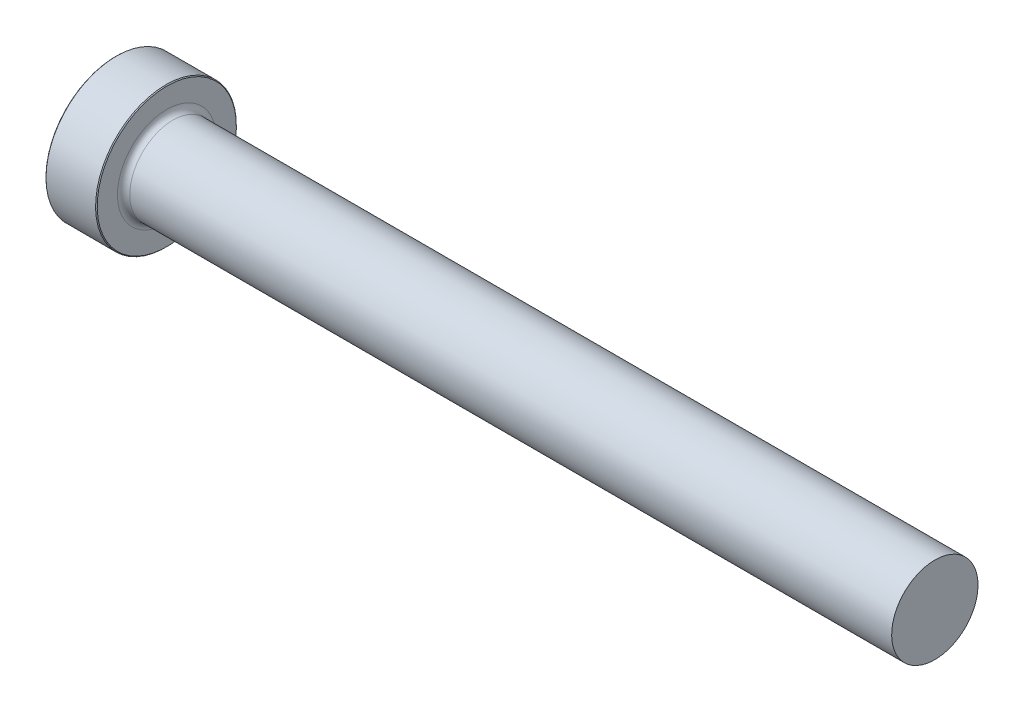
ISO-10303-21;
HEADER;
FILE_DESCRIPTION(('STEP AP214'),'2;1');
FILE_NAME('part.step','',(''),(''),'','','');
FILE_SCHEMA(('AUTOMOTIVE_DESIGN { 1 0 10303 214 1 1 1 1 }'));
ENDSEC;
DATA;
#1=APPLICATION_CONTEXT('core data for automotive mechanical design processes');
#2=APPLICATION_PROTOCOL_DEFINITION('international standard','automotive_design',2000,#1);
#3=PRODUCT_CONTEXT('',#1,'mechanical');
#4=PRODUCT('Part','Part','',(#3));
#5=PRODUCT_RELATED_PRODUCT_CATEGORY('part','',(#4));
#6=PRODUCT_DEFINITION_FORMATION('','',#4);
#7=PRODUCT_DEFINITION_CONTEXT('part definition',#1,'design');
#8=PRODUCT_DEFINITION('design','',#6,#7);
#9=PRODUCT_DEFINITION_SHAPE('','',#8);
#10=(LENGTH_UNIT() NAMED_UNIT(*) SI_UNIT(.MILLI.,.METRE.));
#11=(NAMED_UNIT(*) PLANE_ANGLE_UNIT() SI_UNIT($,.RADIAN.));
#12=(NAMED_UNIT(*) SI_UNIT($,.STERADIAN.) SOLID_ANGLE_UNIT());
#13=UNCERTAINTY_MEASURE_WITH_UNIT(LENGTH_MEASURE(1.E-05),#10,'distance_accuracy_value','');
#14=(GEOMETRIC_REPRESENTATION_CONTEXT(3) GLOBAL_UNCERTAINTY_ASSIGNED_CONTEXT((#13)) GLOBAL_UNIT_ASSIGNED_CONTEXT((#10,
#11,#12)) REPRESENTATION_CONTEXT('',''));
#15=CARTESIAN_POINT('',(0.,0.,0.));
#16=DIRECTION('',(0.,0.,1.));
#17=DIRECTION('',(1.,0.,0.));
#18=AXIS2_PLACEMENT_3D('',#15,#16,#17);
#19=CARTESIAN_POINT('',(101.6,5.35400249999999,0.));
#20=DIRECTION('',(1.,0.,0.));
#21=DIRECTION('',(0.,1.,0.));
#22=AXIS2_PLACEMENT_3D('',#19,#20,#21);
#23=PLANE('',#22);
#24=CARTESIAN_POINT('',(101.6,0.,0.));
#25=DIRECTION('',(1.,0.,0.));
#26=DIRECTION('',(0.,1.,0.));
#27=AXIS2_PLACEMENT_3D('',#24,#25,#26);
#28=CIRCLE('',#27,5.3540025);
#29=CARTESIAN_POINT('',(101.6,5.35400249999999,0.));
#30=VERTEX_POINT('',#29);
#31=EDGE_CURVE('E50',#30,#30,#28,.T.);
#32=ORIENTED_EDGE('',*,*,#31,.T.);
#33=EDGE_LOOP('',(#32));
#34=FACE_BOUND('',#33,.T.);
#35=ADVANCED_FACE('F30',(#34),#23,.T.);
#36=CARTESIAN_POINT('',(101.6,0.,0.));
#37=DIRECTION('',(1.,0.,0.));
#38=DIRECTION('',(0.,1.,0.));
#39=AXIS2_PLACEMENT_3D('',#36,#37,#38);
#40=CYLINDRICAL_SURFACE('',#39,5.3540025);
#41=CARTESIAN_POINT('',(7.11199999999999,0.,0.));
#42=DIRECTION('',(1.,0.,0.));
#43=DIRECTION('',(0.,1.,0.));
#44=AXIS2_PLACEMENT_3D('',#41,#42,#43);
#45=CIRCLE('',#44,5.35400249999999);
#46=CARTESIAN_POINT('',(7.11199999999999,5.35400249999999,0.));
#47=VERTEX_POINT('',#46);
#48=EDGE_CURVE('E53',#47,#47,#45,.T.);
#49=ORIENTED_EDGE('',*,*,#48,.T.);
#50=EDGE_LOOP('',(#49));
#51=FACE_BOUND('',#50,.T.);
#52=ORIENTED_EDGE('',*,*,#31,.F.);
#53=EDGE_LOOP('',(#52));
#54=FACE_BOUND('',#53,.T.);
#55=ADVANCED_FACE('F74',(#51,#54),#40,.T.);
#56=CARTESIAN_POINT('',(7.112,0.,0.));
#57=DIRECTION('',(1.,0.,0.));
#58=DIRECTION('',(0.,1.,0.));
#59=AXIS2_PLACEMENT_3D('',#56,#57,#58);
#60=TOROIDAL_SURFACE('',#59,6.11600249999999,0.761999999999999);
#61=CARTESIAN_POINT('',(6.34999999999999,0.,0.));
#62=DIRECTION('',(1.,0.,0.));
#63=DIRECTION('',(0.,1.,0.));
#64=AXIS2_PLACEMENT_3D('',#61,#62,#63);
#65=CIRCLE('',#64,6.11600249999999);
#66=CARTESIAN_POINT('',(6.34999999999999,6.11600249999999,0.));
#67=VERTEX_POINT('',#66);
#68=EDGE_CURVE('E56',#67,#67,#65,.T.);
#69=ORIENTED_EDGE('',*,*,#68,.T.);
#70=EDGE_LOOP('',(#69));
#71=FACE_BOUND('',#70,.T.);
#72=ORIENTED_EDGE('',*,*,#48,.F.);
#73=EDGE_LOOP('',(#72));
#74=FACE_BOUND('',#73,.T.);
#75=ADVANCED_FACE('F60',(#71,#74),#60,.F.);
#76=CARTESIAN_POINT('',(6.35,8.73125,0.));
#77=DIRECTION('',(1.,0.,0.));
#78=DIRECTION('',(0.,1.,0.));
#79=AXIS2_PLACEMENT_3D('',#76,#77,#78);
#80=PLANE('',#79);
#81=CARTESIAN_POINT('',(6.35,0.,0.));
#82=DIRECTION('',(1.,0.,0.));
#83=DIRECTION('',(0.,1.,0.));
#84=AXIS2_PLACEMENT_3D('',#81,#82,#83);
#85=CIRCLE('',#84,8.62964999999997);
#86=CARTESIAN_POINT('',(6.35,8.62964999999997,0.));
#87=VERTEX_POINT('',#86);
#88=EDGE_CURVE('E10',#87,#87,#85,.T.);
#89=ORIENTED_EDGE('',*,*,#88,.T.);
#90=EDGE_LOOP('',(#89));
#91=FACE_BOUND('',#90,.T.);
#92=ORIENTED_EDGE('',*,*,#68,.F.);
#93=EDGE_LOOP('',(#92));
#94=FACE_BOUND('',#93,.T.);
#95=ADVANCED_FACE('F63',(#91,#94),#80,.T.);
#96=CARTESIAN_POINT('',(101.6,0.,0.));
#97=DIRECTION('',(1.,0.,0.));
#98=DIRECTION('',(0.,1.,0.));
#99=AXIS2_PLACEMENT_3D('',#96,#97,#98);
#100=CYLINDRICAL_SURFACE('',#99,8.73125);
#101=CARTESIAN_POINT('',(0.101600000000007,0.,0.));
#102=DIRECTION('',(-1.,0.,0.));
#103=DIRECTION('',(0.,-1.,0.));
#104=AXIS2_PLACEMENT_3D('',#101,#102,#103);
#105=CIRCLE('',#104,8.73125);
#106=CARTESIAN_POINT('',(0.101600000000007,-8.73125,0.));
#107=VERTEX_POINT('',#106);
#108=EDGE_CURVE('E41',#107,#107,#105,.F.);
#109=ORIENTED_EDGE('',*,*,#108,.T.);
#110=EDGE_LOOP('',(#109));
#111=FACE_BOUND('',#110,.T.);
#112=CARTESIAN_POINT('',(6.24839999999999,0.,0.));
#113=DIRECTION('',(1.,0.,0.));
#114=DIRECTION('',(0.,1.,0.));
#115=AXIS2_PLACEMENT_3D('',#112,#113,#114);
#116=CIRCLE('',#115,8.73125);
#117=CARTESIAN_POINT('',(6.24839999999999,8.73125,0.));
#118=VERTEX_POINT('',#117);
#119=EDGE_CURVE('E45',#118,#118,#116,.F.);
#120=ORIENTED_EDGE('',*,*,#119,.T.);
#121=EDGE_LOOP('',(#120));
#122=FACE_BOUND('',#121,.T.);
#123=ADVANCED_FACE('F65',(#111,#122),#100,.T.);
#124=CARTESIAN_POINT('',(0.,0.,0.));
#125=DIRECTION('',(-1.,0.,0.));
#126=DIRECTION('',(0.,-1.,0.));
#127=AXIS2_PLACEMENT_3D('',#124,#125,#126);
#128=PLANE('',#127);
#129=CARTESIAN_POINT('',(0.,0.,0.));
#130=DIRECTION('',(-1.,0.,0.));
#131=DIRECTION('',(0.,-1.,0.));
#132=AXIS2_PLACEMENT_3D('',#129,#130,#131);
#133=CIRCLE('',#132,8.62964999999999);
#134=CARTESIAN_POINT('',(0.,-8.62964999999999,0.));
#135=VERTEX_POINT('',#134);
#136=EDGE_CURVE('E37',#135,#135,#133,.T.);
#137=ORIENTED_EDGE('',*,*,#136,.T.);
#138=EDGE_LOOP('',(#137));
#139=FACE_BOUND('',#138,.T.);
#140=ADVANCED_FACE('F71',(#139),#128,.T.);
#141=CARTESIAN_POINT('',(0.101600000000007,0.,0.));
#142=DIRECTION('',(1.,0.,0.));
#143=DIRECTION('',(0.,1.,0.));
#144=AXIS2_PLACEMENT_3D('',#141,#142,#143);
#145=CONICAL_SURFACE('',#144,8.73125,0.785398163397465);
#146=ORIENTED_EDGE('',*,*,#136,.F.);
#147=EDGE_LOOP('',(#146));
#148=FACE_BOUND('',#147,.T.);
#149=ORIENTED_EDGE('',*,*,#108,.F.);
#150=EDGE_LOOP('',(#149));
#151=FACE_BOUND('',#150,.T.);
#152=ADVANCED_FACE('F84',(#148,#151),#145,.T.);
#153=CARTESIAN_POINT('',(6.34999999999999,0.,0.));
#154=DIRECTION('',(-1.,0.,0.));
#155=DIRECTION('',(0.,-1.,0.));
#156=AXIS2_PLACEMENT_3D('',#153,#154,#155);
#157=CONICAL_SURFACE('',#156,8.62964999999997,0.785398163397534);
#158=ORIENTED_EDGE('',*,*,#119,.F.);
#159=EDGE_LOOP('',(#158));
#160=FACE_BOUND('',#159,.T.);
#161=ORIENTED_EDGE('',*,*,#88,.F.);
#162=EDGE_LOOP('',(#161));
#163=FACE_BOUND('',#162,.T.);
#164=ADVANCED_FACE('F32',(#160,#163),#157,.T.);
#165=CLOSED_SHELL('',(#35,#55,#75,#95,#123,#140,#152,#164));
#166=MANIFOLD_SOLID_BREP('B2',#165);
#167=ADVANCED_BREP_SHAPE_REPRESENTATION('',(#18,#166),#14);
#168=SHAPE_DEFINITION_REPRESENTATION(#9,#167);
ENDSEC;
END-ISO-10303-21;
